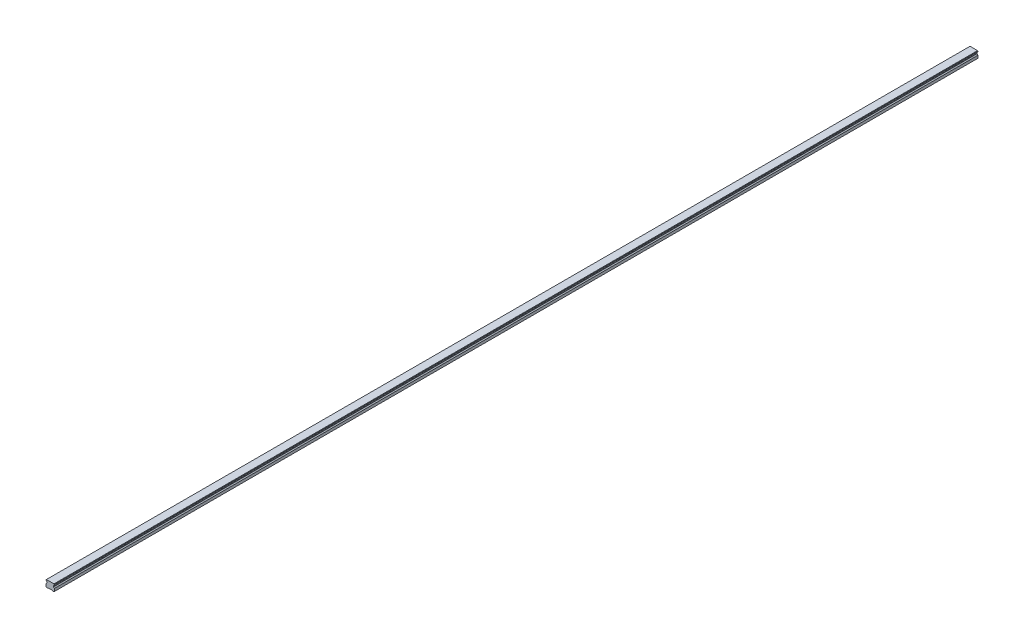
from build123d import *

# Parameters (mm, degrees)
SKETCH1_W           = 20
SKETCH1_H           = 16.3
BOSS_EXTRUDE1_DEPTH = 1100
CUT_EXTRUDE1_DEPTH  = 2201.083109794
CHAMFER1_SIZE       = 1
FILLET1_R           = 1
CUT_EXTRUDE2_DEPTH  = 2201.083109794
SKETCH5_R           = 3
SKETCH5_R_2         = 2.5
CUT_EXTRUDE5_DEPTH  = 10
SKETCH5_2_R         = 2.5
CUT_EXTRUDE6_DEPTH  = 13
LPATTERN2_COUNT     = 37
LPATTERN2_PITCH     = 60


with BuildPart() as part:
    # Sketch1 → Boss-Extrude1 (new, symmetric)
    with BuildSketch(Plane.XY):
        with Locations((0, 8.15)):
            Rectangle(SKETCH1_W, SKETCH1_H)
    extrude(amount=BOSS_EXTRUDE1_DEPTH, both=True)

    # Sketch2 → Cut-Extrude1 (cut, through all)
    with BuildSketch(Plane.XY.offset(1100)):
        Polygon((-10, 14.3), (-10, 7.3), (-7.666666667, 9.633333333), (-7.666666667, 11.966666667), align=None)
        Polygon((7.666666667, 11.966666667), (10, 14.3), (10, 7.3), (7.666666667, 9.633333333), align=None)
    extrude(amount=-CUT_EXTRUDE1_DEPTH, mode=Mode.SUBTRACT)

    # Chamfer1
    chamfer1_edges = [part.edges().sort_by_distance(p)[0] for p in [
        (-10, 16.3, 0),
        (10, 16.3, 0),
        (10, 0, 0),
        (-10, 0, 0),
    ]]
    chamfer(chamfer1_edges, length=CHAMFER1_SIZE)

    # Fillet1
    fillet1_edges = [part.edges().sort_by_distance(p)[0] for p in [
        (-7.666666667, 11.966666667, 0),
        (-7.666666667, 9.633333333, 0),
        (7.666666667, 9.633333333, 0),
        (7.666666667, 11.966666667, 0),
    ]]
    fillet(fillet1_edges, radius=FILLET1_R)

    # Sketch3 → Cut-Extrude2 (cut, through all)
    with BuildSketch(Plane.XY.offset(1100)):
        Polygon((-6, 0), (-5, 1), (5, 1), (6, 0), align=None)
    extrude(amount=-CUT_EXTRUDE2_DEPTH, mode=Mode.SUBTRACT)

    # Sketch5 → Cut-Extrude5 (cut)
    with BuildSketch(Plane.XZ.offset(-1)):
        with Locations(Location((0, 1080, 0), (0, 0, 270))):
            Circle(SKETCH5_R)
        with Locations(Location((0, 1080, 0), (0, 0, 270))):
            Circle(SKETCH5_R_2, mode=Mode.SUBTRACT)
    cut_extrude5 = extrude(amount=-CUT_EXTRUDE5_DEPTH, mode=Mode.SUBTRACT)

    # Sketch5_2 → Cut-Extrude6 (cut)
    with BuildSketch(Plane.XZ.offset(-1)):
        with Locations(Location((0, 1080, 0), (0, 0, 270))):
            Circle(SKETCH5_2_R)
    cut_extrude6 = extrude(amount=-CUT_EXTRUDE6_DEPTH, mode=Mode.SUBTRACT)

    # Cut-Extrude7 cone 1 section (on through the dimple's axis) → Cut-Extrude7 (revolve, cut)
    with BuildSketch(Plane(origin=(0, 14, 1080), x_dir=(0, 0, -1), z_dir=(1, 0, 0))):
        Polygon((0, 0), (2.5, 0), (0, 1.443375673), align=None)
    cut_extrude7 = revolve(axis=Axis((0, 14, 1080), (0, 1, 0)), mode=Mode.SUBTRACT)

    # LPattern2: Cut-Extrude5, Cut-Extrude6, Cut-Extrude7 ×37
    with Locations(*[(0, 0, -i * LPATTERN2_PITCH) for i in range(1, LPATTERN2_COUNT)]):
        add(cut_extrude5, mode=Mode.SUBTRACT)
        add(cut_extrude6, mode=Mode.SUBTRACT)
        add(cut_extrude7, mode=Mode.SUBTRACT)


solid = part.part
